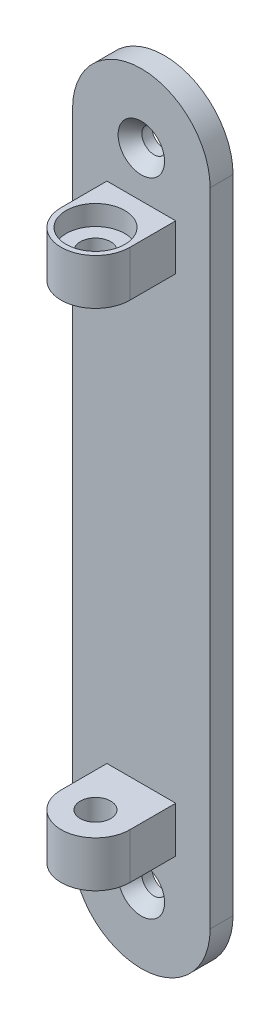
from build123d import *

# Parameters (mm, degrees)
EXTRUDE1_DEPTH                                     = 6.35
SKETCH6_W                                          = 19.05
SKETCH6_H                                          = 12.7
EXTRUDE2_DEPTH                                     = 12.7
EXTRUDE3_DEPTH                                     = 12.7
CBORE_FOR_5_16_PAN_HEAD_MACHINE_SCREW1_D           = 8.4328
CBORE_FOR_5_16_PAN_HEAD_MACHINE_SCREW1_DEPTH       = 12.7
CBORE_FOR_5_16_PAN_HEAD_MACHINE_SCREW1_CBORE_D     = 16.27124
CBORE_FOR_5_16_PAN_HEAD_MACHINE_SCREW1_CBORE_DEPTH = 5.5372
CBORE_FOR_5_16_PAN_HEAD_MACHINE_SCREW1_TIP         = 2.533468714


with BuildPart() as part:
    # Sketch1 → Extrude1 (new body)
    with BuildSketch(Plane.XY):
        with BuildLine():
            Line((0, 0), (0, 88.9))
            ThreePointArc((0, 88.9), (19.05, 107.95), (38.1, 88.9))
            Line((38.1, 88.9), (38.1, 0))
            Line((38.1, 0), (0, 0))
        make_face()
    extrude(amount=EXTRUDE1_DEPTH)

    # Sketch4 → CSK for 1_4 Flat Head Machine Screw1 (revolve, cut)
    with BuildSketch(Plane(origin=(19.05, 88.9, 6.35), x_dir=(0, -1, 0), z_dir=(1, 0, 0))):
        Polygon((0, 0), (0, 6.35), (3.3782, 6.35), (3.3782, 3.520932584), (6.4389, 0), align=None)
    revolve(axis=Axis((19.05, 88.9, 12.7), (0, 0, -1)), mode=Mode.SUBTRACT)

    # Sketch6 → Extrude2 (add)
    with BuildSketch(Plane.XY.offset(6.35)):
        with Locations((19.05, 69.85)):
            Rectangle(SKETCH6_W, SKETCH6_H)
    extrude(amount=EXTRUDE2_DEPTH)

    # Sketch7 → Extrude3 (add)
    with BuildSketch(Plane(origin=(0, 76.2, 0), x_dir=(-1, 0, 0), z_dir=(0, 1, 0))):
        with BuildLine():
            Line((-9.525, 19.05), (-28.575, 19.05))
            ThreePointArc((-28.575, 19.05), (-19.05, 28.575), (-9.525, 19.05))
        make_face()
    extrude(amount=-EXTRUDE3_DEPTH)

    # CBORE for 5_16 Pan Head Machine Screw1
    with Locations(Plane(origin=(0, 76.2, 0), x_dir=(-1, 0, 0), z_dir=(0, 1, 0))):
        with Locations((-19.05, 19.05)):
            CounterBoreHole(CBORE_FOR_5_16_PAN_HEAD_MACHINE_SCREW1_D / 2, CBORE_FOR_5_16_PAN_HEAD_MACHINE_SCREW1_CBORE_D / 2, CBORE_FOR_5_16_PAN_HEAD_MACHINE_SCREW1_CBORE_DEPTH, depth=CBORE_FOR_5_16_PAN_HEAD_MACHINE_SCREW1_DEPTH)
            with Locations((0, 0, -(CBORE_FOR_5_16_PAN_HEAD_MACHINE_SCREW1_DEPTH + CBORE_FOR_5_16_PAN_HEAD_MACHINE_SCREW1_TIP / 2))):  # 118° drill point
                Cone(0, CBORE_FOR_5_16_PAN_HEAD_MACHINE_SCREW1_D / 2, CBORE_FOR_5_16_PAN_HEAD_MACHINE_SCREW1_TIP, mode=Mode.SUBTRACT)

    # Mirror1: part across plane


with BuildPart() as part_1:
    add(part.part)
    add(part.part.mirror(Plane(origin=(38.1, 0, 6.35), x_dir=(0, 0, 1), z_dir=(0, 1, 0))))


solid = part_1.part
